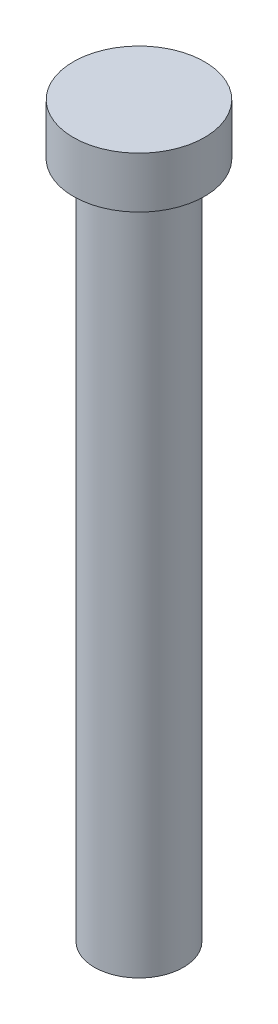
ISO-10303-21;
HEADER;
FILE_DESCRIPTION(('STEP AP214'),'2;1');
FILE_NAME('part.step','',(''),(''),'','','');
FILE_SCHEMA(('AUTOMOTIVE_DESIGN { 1 0 10303 214 1 1 1 1 }'));
ENDSEC;
DATA;
#1=APPLICATION_CONTEXT('core data for automotive mechanical design processes');
#2=APPLICATION_PROTOCOL_DEFINITION('international standard','automotive_design',2000,#1);
#3=PRODUCT_CONTEXT('',#1,'mechanical');
#4=PRODUCT('Part','Part','',(#3));
#5=PRODUCT_RELATED_PRODUCT_CATEGORY('part','',(#4));
#6=PRODUCT_DEFINITION_FORMATION('','',#4);
#7=PRODUCT_DEFINITION_CONTEXT('part definition',#1,'design');
#8=PRODUCT_DEFINITION('design','',#6,#7);
#9=PRODUCT_DEFINITION_SHAPE('','',#8);
#10=(LENGTH_UNIT() NAMED_UNIT(*) SI_UNIT(.MILLI.,.METRE.));
#11=(NAMED_UNIT(*) PLANE_ANGLE_UNIT() SI_UNIT($,.RADIAN.));
#12=(NAMED_UNIT(*) SI_UNIT($,.STERADIAN.) SOLID_ANGLE_UNIT());
#13=UNCERTAINTY_MEASURE_WITH_UNIT(LENGTH_MEASURE(1.E-05),#10,'distance_accuracy_value','');
#14=(GEOMETRIC_REPRESENTATION_CONTEXT(3) GLOBAL_UNCERTAINTY_ASSIGNED_CONTEXT((#13)) GLOBAL_UNIT_ASSIGNED_CONTEXT((#10,
#11,#12)) REPRESENTATION_CONTEXT('',''));
#15=CARTESIAN_POINT('',(0.,0.,0.));
#16=DIRECTION('',(0.,0.,1.));
#17=DIRECTION('',(1.,0.,0.));
#18=AXIS2_PLACEMENT_3D('',#15,#16,#17);
#19=CARTESIAN_POINT('',(0.,-100.,0.));
#20=DIRECTION('',(0.,1.,0.));
#21=DIRECTION('',(0.,0.,1.));
#22=AXIS2_PLACEMENT_3D('',#19,#20,#21);
#23=CYLINDRICAL_SURFACE('',#22,6.1);
#24=CARTESIAN_POINT('',(0.,-7.8,0.));
#25=DIRECTION('',(0.,1.,0.));
#26=DIRECTION('',(0.,0.,1.));
#27=AXIS2_PLACEMENT_3D('',#24,#25,#26);
#28=CIRCLE('',#27,6.1);
#29=CARTESIAN_POINT('',(0.,-7.8,6.1));
#30=VERTEX_POINT('',#29);
#31=EDGE_CURVE('E35',#30,#30,#28,.F.);
#32=ORIENTED_EDGE('',*,*,#31,.T.);
#33=EDGE_LOOP('',(#32));
#34=FACE_BOUND('',#33,.T.);
#35=CARTESIAN_POINT('',(0.,-100.,0.));
#36=DIRECTION('',(0.,1.,0.));
#37=DIRECTION('',(0.,0.,1.));
#38=AXIS2_PLACEMENT_3D('',#35,#36,#37);
#39=CIRCLE('',#38,6.1);
#40=CARTESIAN_POINT('',(0.,-100.,6.1));
#41=VERTEX_POINT('',#40);
#42=EDGE_CURVE('E39',#41,#41,#39,.T.);
#43=ORIENTED_EDGE('',*,*,#42,.T.);
#44=EDGE_LOOP('',(#43));
#45=FACE_BOUND('',#44,.T.);
#46=ADVANCED_FACE('F28',(#34,#45),#23,.T.);
#47=CARTESIAN_POINT('',(0.,-100.,0.));
#48=DIRECTION('',(0.,1.,0.));
#49=DIRECTION('',(0.,0.,1.));
#50=AXIS2_PLACEMENT_3D('',#47,#48,#49);
#51=PLANE('',#50);
#52=ORIENTED_EDGE('',*,*,#42,.F.);
#53=EDGE_LOOP('',(#52));
#54=FACE_BOUND('',#53,.T.);
#55=ADVANCED_FACE('F65',(#54),#51,.F.);
#56=CARTESIAN_POINT('',(0.,-7.,0.));
#57=DIRECTION('',(0.,1.,0.));
#58=DIRECTION('',(0.,0.,1.));
#59=AXIS2_PLACEMENT_3D('',#56,#57,#58);
#60=CYLINDRICAL_SURFACE('',#59,9.);
#61=CARTESIAN_POINT('',(0.,-7.,0.));
#62=DIRECTION('',(0.,1.,0.));
#63=DIRECTION('',(0.,0.,1.));
#64=AXIS2_PLACEMENT_3D('',#61,#62,#63);
#65=CIRCLE('',#64,9.);
#66=CARTESIAN_POINT('',(0.,-7.,9.));
#67=VERTEX_POINT('',#66);
#68=EDGE_CURVE('E43',#67,#67,#65,.T.);
#69=ORIENTED_EDGE('',*,*,#68,.T.);
#70=EDGE_LOOP('',(#69));
#71=FACE_BOUND('',#70,.T.);
#72=CARTESIAN_POINT('',(0.,0.,0.));
#73=DIRECTION('',(0.,1.,0.));
#74=DIRECTION('',(0.,0.,1.));
#75=AXIS2_PLACEMENT_3D('',#72,#73,#74);
#76=CIRCLE('',#75,9.);
#77=CARTESIAN_POINT('',(0.,0.,9.));
#78=VERTEX_POINT('',#77);
#79=EDGE_CURVE('E46',#78,#78,#76,.T.);
#80=ORIENTED_EDGE('',*,*,#79,.F.);
#81=EDGE_LOOP('',(#80));
#82=FACE_BOUND('',#81,.T.);
#83=ADVANCED_FACE('F52',(#71,#82),#60,.T.);
#84=CARTESIAN_POINT('',(0.,-7.,0.));
#85=DIRECTION('',(0.,1.,0.));
#86=DIRECTION('',(0.,0.,1.));
#87=AXIS2_PLACEMENT_3D('',#84,#85,#86);
#88=PLANE('',#87);
#89=CARTESIAN_POINT('',(0.,-7.,0.));
#90=DIRECTION('',(0.,1.,0.));
#91=DIRECTION('',(0.,0.,1.));
#92=AXIS2_PLACEMENT_3D('',#89,#90,#91);
#93=CIRCLE('',#92,6.9);
#94=CARTESIAN_POINT('',(0.,-7.,6.9));
#95=VERTEX_POINT('',#94);
#96=EDGE_CURVE('E10',#95,#95,#93,.T.);
#97=ORIENTED_EDGE('',*,*,#96,.T.);
#98=EDGE_LOOP('',(#97));
#99=FACE_BOUND('',#98,.T.);
#100=ORIENTED_EDGE('',*,*,#68,.F.);
#101=EDGE_LOOP('',(#100));
#102=FACE_BOUND('',#101,.T.);
#103=ADVANCED_FACE('F55',(#99,#102),#88,.F.);
#104=CARTESIAN_POINT('',(0.,0.,0.));
#105=DIRECTION('',(0.,1.,0.));
#106=DIRECTION('',(0.,0.,1.));
#107=AXIS2_PLACEMENT_3D('',#104,#105,#106);
#108=PLANE('',#107);
#109=ORIENTED_EDGE('',*,*,#79,.T.);
#110=EDGE_LOOP('',(#109));
#111=FACE_BOUND('',#110,.T.);
#112=ADVANCED_FACE('F57',(#111),#108,.T.);
#113=CARTESIAN_POINT('',(0.,-7.8,0.));
#114=DIRECTION('',(0.,1.,0.));
#115=DIRECTION('',(0.,0.,1.));
#116=AXIS2_PLACEMENT_3D('',#113,#114,#115);
#117=TOROIDAL_SURFACE('',#116,6.9,0.8);
#118=ORIENTED_EDGE('',*,*,#96,.F.);
#119=EDGE_LOOP('',(#118));
#120=FACE_BOUND('',#119,.T.);
#121=ORIENTED_EDGE('',*,*,#31,.F.);
#122=EDGE_LOOP('',(#121));
#123=FACE_BOUND('',#122,.T.);
#124=ADVANCED_FACE('F30',(#120,#123),#117,.F.);
#125=CLOSED_SHELL('',(#46,#55,#83,#103,#112,#124));
#126=MANIFOLD_SOLID_BREP('B2',#125);
#127=ADVANCED_BREP_SHAPE_REPRESENTATION('',(#18,#126),#14);
#128=SHAPE_DEFINITION_REPRESENTATION(#9,#127);
ENDSEC;
END-ISO-10303-21;
